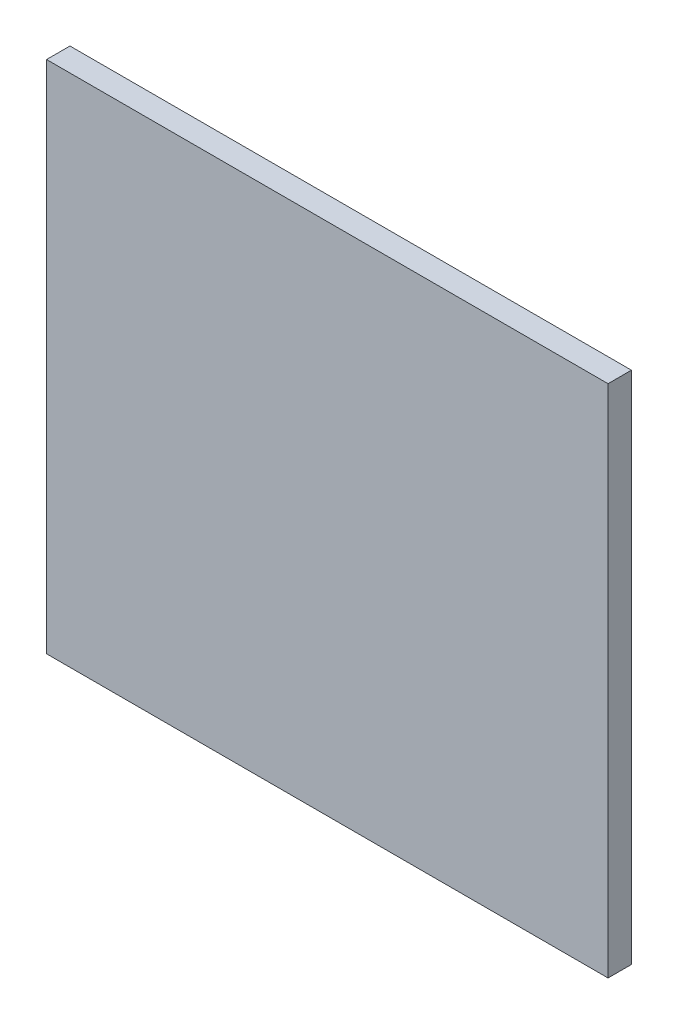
ISO-10303-21;
HEADER;
FILE_DESCRIPTION(('STEP AP214'),'2;1');
FILE_NAME('part.step','',(''),(''),'','','');
FILE_SCHEMA(('AUTOMOTIVE_DESIGN { 1 0 10303 214 1 1 1 1 }'));
ENDSEC;
DATA;
#1=APPLICATION_CONTEXT('core data for automotive mechanical design processes');
#2=APPLICATION_PROTOCOL_DEFINITION('international standard','automotive_design',2000,#1);
#3=PRODUCT_CONTEXT('',#1,'mechanical');
#4=PRODUCT('Part','Part','',(#3));
#5=PRODUCT_RELATED_PRODUCT_CATEGORY('part','',(#4));
#6=PRODUCT_DEFINITION_FORMATION('','',#4);
#7=PRODUCT_DEFINITION_CONTEXT('part definition',#1,'design');
#8=PRODUCT_DEFINITION('design','',#6,#7);
#9=PRODUCT_DEFINITION_SHAPE('','',#8);
#10=(LENGTH_UNIT() NAMED_UNIT(*) SI_UNIT(.MILLI.,.METRE.));
#11=(NAMED_UNIT(*) PLANE_ANGLE_UNIT() SI_UNIT($,.RADIAN.));
#12=(NAMED_UNIT(*) SI_UNIT($,.STERADIAN.) SOLID_ANGLE_UNIT());
#13=UNCERTAINTY_MEASURE_WITH_UNIT(LENGTH_MEASURE(1.E-05),#10,'distance_accuracy_value','');
#14=(GEOMETRIC_REPRESENTATION_CONTEXT(3) GLOBAL_UNCERTAINTY_ASSIGNED_CONTEXT((#13)) GLOBAL_UNIT_ASSIGNED_CONTEXT((#10,
#11,#12)) REPRESENTATION_CONTEXT('',''));
#15=CARTESIAN_POINT('',(0.,0.,0.));
#16=DIRECTION('',(0.,0.,1.));
#17=DIRECTION('',(1.,0.,0.));
#18=AXIS2_PLACEMENT_3D('',#15,#16,#17);
#19=CARTESIAN_POINT('',(0.,0.,50.8));
#20=DIRECTION('',(1.,0.,0.));
#21=DIRECTION('',(0.,1.,0.));
#22=AXIS2_PLACEMENT_3D('',#19,#20,#21);
#23=PLANE('',#22);
#24=DIRECTION('',(0.,-1.,0.));
#25=VECTOR('',#24,1.);
#26=CARTESIAN_POINT('',(0.,0.,0.));
#27=LINE('',#26,#25);
#28=CARTESIAN_POINT('',(-2.22044604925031E-13,1117.6,0.));
#29=VERTEX_POINT('',#28);
#30=CARTESIAN_POINT('',(0.,0.,0.));
#31=VERTEX_POINT('',#30);
#32=EDGE_CURVE('E95',#29,#31,#27,.T.);
#33=ORIENTED_EDGE('',*,*,#32,.T.);
#34=DIRECTION('',(0.,0.,-1.));
#35=VECTOR('',#34,1.);
#36=CARTESIAN_POINT('',(0.,0.,50.8));
#37=LINE('',#36,#35);
#38=CARTESIAN_POINT('',(0.,0.,50.8));
#39=VERTEX_POINT('',#38);
#40=EDGE_CURVE('E11',#39,#31,#37,.T.);
#41=ORIENTED_EDGE('',*,*,#40,.F.);
#42=DIRECTION('',(0.,-1.,0.));
#43=VECTOR('',#42,1.);
#44=CARTESIAN_POINT('',(0.,0.,50.8));
#45=LINE('',#44,#43);
#46=CARTESIAN_POINT('',(-2.22044604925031E-13,1117.6,50.8));
#47=VERTEX_POINT('',#46);
#48=EDGE_CURVE('E83',#47,#39,#45,.T.);
#49=ORIENTED_EDGE('',*,*,#48,.F.);
#50=DIRECTION('',(0.,0.,-1.));
#51=VECTOR('',#50,1.);
#52=CARTESIAN_POINT('',(-2.22044604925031E-13,1117.6,50.8));
#53=LINE('',#52,#51);
#54=EDGE_CURVE('E91',#47,#29,#53,.T.);
#55=ORIENTED_EDGE('',*,*,#54,.T.);
#56=EDGE_LOOP('',(#33,#41,#49,#55));
#57=FACE_BOUND('',#56,.T.);
#58=ADVANCED_FACE('F32',(#57),#23,.F.);
#59=CARTESIAN_POINT('',(0.,0.,50.8));
#60=DIRECTION('',(0.,1.,0.));
#61=DIRECTION('',(0.,0.,1.));
#62=AXIS2_PLACEMENT_3D('',#59,#60,#61);
#63=PLANE('',#62);
#64=DIRECTION('',(1.,0.,0.));
#65=VECTOR('',#64,1.);
#66=CARTESIAN_POINT('',(0.,0.,0.));
#67=LINE('',#66,#65);
#68=CARTESIAN_POINT('',(1219.2,0.,0.));
#69=VERTEX_POINT('',#68);
#70=EDGE_CURVE('E87',#31,#69,#67,.T.);
#71=ORIENTED_EDGE('',*,*,#70,.T.);
#72=DIRECTION('',(0.,0.,-1.));
#73=VECTOR('',#72,1.);
#74=CARTESIAN_POINT('',(1219.2,0.,50.8));
#75=LINE('',#74,#73);
#76=CARTESIAN_POINT('',(1219.2,0.,50.8));
#77=VERTEX_POINT('',#76);
#78=EDGE_CURVE('E40',#77,#69,#75,.T.);
#79=ORIENTED_EDGE('',*,*,#78,.F.);
#80=DIRECTION('',(1.,0.,0.));
#81=VECTOR('',#80,1.);
#82=CARTESIAN_POINT('',(0.,0.,50.8));
#83=LINE('',#82,#81);
#84=EDGE_CURVE('E78',#39,#77,#83,.T.);
#85=ORIENTED_EDGE('',*,*,#84,.F.);
#86=ORIENTED_EDGE('',*,*,#40,.T.);
#87=EDGE_LOOP('',(#71,#79,#85,#86));
#88=FACE_BOUND('',#87,.T.);
#89=ADVANCED_FACE('F86',(#88),#63,.F.);
#90=CARTESIAN_POINT('',(1219.2,0.,50.8));
#91=DIRECTION('',(-1.,0.,0.));
#92=DIRECTION('',(0.,-1.,0.));
#93=AXIS2_PLACEMENT_3D('',#90,#91,#92);
#94=PLANE('',#93);
#95=DIRECTION('',(0.,1.,0.));
#96=VECTOR('',#95,1.);
#97=CARTESIAN_POINT('',(1219.2,0.,0.));
#98=LINE('',#97,#96);
#99=CARTESIAN_POINT('',(1219.2,1117.6,0.));
#100=VERTEX_POINT('',#99);
#101=EDGE_CURVE('E65',#69,#100,#98,.T.);
#102=ORIENTED_EDGE('',*,*,#101,.T.);
#103=DIRECTION('',(0.,0.,-1.));
#104=VECTOR('',#103,1.);
#105=CARTESIAN_POINT('',(1219.2,1117.6,50.8));
#106=LINE('',#105,#104);
#107=CARTESIAN_POINT('',(1219.2,1117.6,50.8));
#108=VERTEX_POINT('',#107);
#109=EDGE_CURVE('E88',#108,#100,#106,.T.);
#110=ORIENTED_EDGE('',*,*,#109,.F.);
#111=DIRECTION('',(0.,1.,0.));
#112=VECTOR('',#111,1.);
#113=CARTESIAN_POINT('',(1219.2,0.,50.8));
#114=LINE('',#113,#112);
#115=EDGE_CURVE('E81',#77,#108,#114,.T.);
#116=ORIENTED_EDGE('',*,*,#115,.F.);
#117=ORIENTED_EDGE('',*,*,#78,.T.);
#118=EDGE_LOOP('',(#102,#110,#116,#117));
#119=FACE_BOUND('',#118,.T.);
#120=ADVANCED_FACE('F89',(#119),#94,.F.);
#121=CARTESIAN_POINT('',(-2.22044604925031E-13,1117.6,50.8));
#122=DIRECTION('',(0.,-1.,0.));
#123=DIRECTION('',(0.,0.,-1.));
#124=AXIS2_PLACEMENT_3D('',#121,#122,#123);
#125=PLANE('',#124);
#126=DIRECTION('',(-1.,0.,0.));
#127=VECTOR('',#126,1.);
#128=CARTESIAN_POINT('',(-2.22044604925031E-13,1117.6,0.));
#129=LINE('',#128,#127);
#130=EDGE_CURVE('E71',#100,#29,#129,.T.);
#131=ORIENTED_EDGE('',*,*,#130,.T.);
#132=ORIENTED_EDGE('',*,*,#54,.F.);
#133=DIRECTION('',(-1.,0.,0.));
#134=VECTOR('',#133,1.);
#135=CARTESIAN_POINT('',(-2.22044604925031E-13,1117.6,50.8));
#136=LINE('',#135,#134);
#137=EDGE_CURVE('E48',#108,#47,#136,.T.);
#138=ORIENTED_EDGE('',*,*,#137,.F.);
#139=ORIENTED_EDGE('',*,*,#109,.T.);
#140=EDGE_LOOP('',(#131,#132,#138,#139));
#141=FACE_BOUND('',#140,.T.);
#142=ADVANCED_FACE('F102',(#141),#125,.F.);
#143=CARTESIAN_POINT('',(0.,0.,50.8));
#144=DIRECTION('',(0.,0.,-1.));
#145=DIRECTION('',(-1.,0.,0.));
#146=AXIS2_PLACEMENT_3D('',#143,#144,#145);
#147=PLANE('',#146);
#148=ORIENTED_EDGE('',*,*,#48,.T.);
#149=ORIENTED_EDGE('',*,*,#84,.T.);
#150=ORIENTED_EDGE('',*,*,#115,.T.);
#151=ORIENTED_EDGE('',*,*,#137,.T.);
#152=EDGE_LOOP('',(#148,#149,#150,#151));
#153=FACE_BOUND('',#152,.T.);
#154=ADVANCED_FACE('F79',(#153),#147,.F.);
#155=CARTESIAN_POINT('',(0.,0.,0.));
#156=DIRECTION('',(0.,0.,-1.));
#157=DIRECTION('',(-1.,0.,0.));
#158=AXIS2_PLACEMENT_3D('',#155,#156,#157);
#159=PLANE('',#158);
#160=ORIENTED_EDGE('',*,*,#32,.F.);
#161=ORIENTED_EDGE('',*,*,#130,.F.);
#162=ORIENTED_EDGE('',*,*,#101,.F.);
#163=ORIENTED_EDGE('',*,*,#70,.F.);
#164=EDGE_LOOP('',(#160,#161,#162,#163));
#165=FACE_BOUND('',#164,.T.);
#166=ADVANCED_FACE('F105',(#165),#159,.T.);
#167=CLOSED_SHELL('',(#58,#89,#120,#142,#154,#166));
#168=MANIFOLD_SOLID_BREP('B2',#167);
#169=ADVANCED_BREP_SHAPE_REPRESENTATION('',(#18,#168),#14);
#170=SHAPE_DEFINITION_REPRESENTATION(#9,#169);
ENDSEC;
END-ISO-10303-21;
